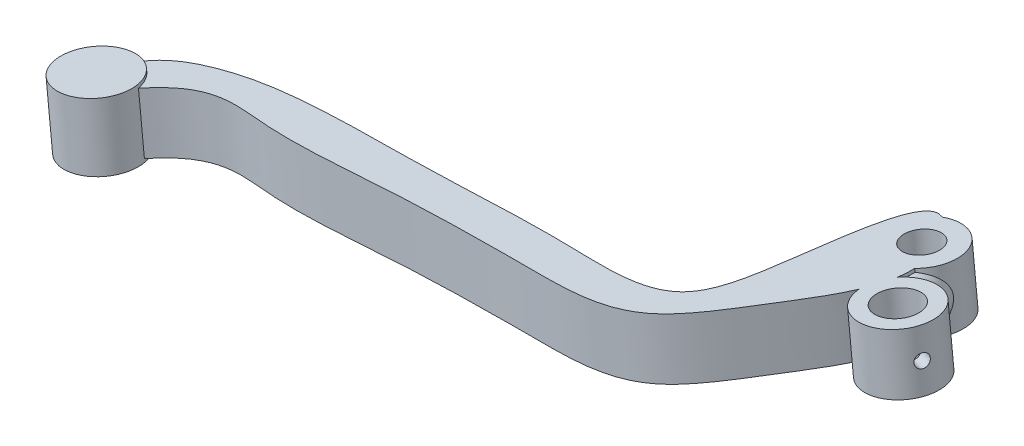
ISO-10303-21;
HEADER;
FILE_DESCRIPTION(('STEP AP214'),'2;1');
FILE_NAME('part.step','',(''),(''),'','','');
FILE_SCHEMA(('AUTOMOTIVE_DESIGN { 1 0 10303 214 1 1 1 1 }'));
ENDSEC;
DATA;
#1=APPLICATION_CONTEXT('core data for automotive mechanical design processes');
#2=APPLICATION_PROTOCOL_DEFINITION('international standard','automotive_design',2000,#1);
#3=PRODUCT_CONTEXT('',#1,'mechanical');
#4=PRODUCT('Part','Part','',(#3));
#5=PRODUCT_RELATED_PRODUCT_CATEGORY('part','',(#4));
#6=PRODUCT_DEFINITION_FORMATION('','',#4);
#7=PRODUCT_DEFINITION_CONTEXT('part definition',#1,'design');
#8=PRODUCT_DEFINITION('design','',#6,#7);
#9=PRODUCT_DEFINITION_SHAPE('','',#8);
#10=(LENGTH_UNIT() NAMED_UNIT(*) SI_UNIT(.MILLI.,.METRE.));
#11=(NAMED_UNIT(*) PLANE_ANGLE_UNIT() SI_UNIT($,.RADIAN.));
#12=(NAMED_UNIT(*) SI_UNIT($,.STERADIAN.) SOLID_ANGLE_UNIT());
#13=UNCERTAINTY_MEASURE_WITH_UNIT(LENGTH_MEASURE(1.E-05),#10,'distance_accuracy_value','');
#14=(GEOMETRIC_REPRESENTATION_CONTEXT(3) GLOBAL_UNCERTAINTY_ASSIGNED_CONTEXT((#13)) GLOBAL_UNIT_ASSIGNED_CONTEXT((#10,
#11,#12)) REPRESENTATION_CONTEXT('',''));
#15=CARTESIAN_POINT('',(0.,0.,0.));
#16=DIRECTION('',(0.,0.,1.));
#17=DIRECTION('',(1.,0.,0.));
#18=AXIS2_PLACEMENT_3D('',#15,#16,#17);
#19=CARTESIAN_POINT('',(-251.154082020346,35.3664784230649,9.63590287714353));
#20=CARTESIAN_POINT('',(-252.144752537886,35.26541001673,6.79477720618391));
#21=CARTESIAN_POINT('',(-259.753498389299,34.4891642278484,-3.37683043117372));
#22=CARTESIAN_POINT('',(-262.065558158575,34.2532874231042,19.9311795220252));
#23=CARTESIAN_POINT('',(-265.881433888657,33.8639910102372,35.6466948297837));
#24=CARTESIAN_POINT('',(-287.423761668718,31.6662383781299,32.1428645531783));
#25=CARTESIAN_POINT('',(-305.955974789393,29.7755782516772,31.6126026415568));
#26=CARTESIAN_POINT('',(-325.574866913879,27.7740549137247,29.3290289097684));
#27=CARTESIAN_POINT('',(-340.025373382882,26.2998113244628,29.8606462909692));
#28=CARTESIAN_POINT('',(-349.502064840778,25.332997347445,34.200079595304));
#29=CARTESIAN_POINT('',(-350.796580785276,25.200930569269,47.4223544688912));
#30=CARTESIAN_POINT('',(-340.315774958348,26.2701844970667,32.7727968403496));
#31=CARTESIAN_POINT('',(-326.270514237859,27.7030848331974,36.7307682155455));
#32=CARTESIAN_POINT('',(-306.666064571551,29.703134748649,36.9124291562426));
#33=CARTESIAN_POINT('',(-287.296502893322,31.6792213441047,38.6130664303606));
#34=CARTESIAN_POINT('',(-266.955256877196,33.7544393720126,40.9172491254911));
#35=CARTESIAN_POINT('',(-257.023135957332,34.7677163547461,26.5391105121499));
#36=CARTESIAN_POINT('',(-248.785632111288,35.6081081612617,16.4283366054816));
#37=CARTESIAN_POINT('',(-251.154082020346,35.3664784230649,9.63590287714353));
#38=B_SPLINE_CURVE_WITH_KNOTS('',3,(#19,#20,#21,#22,#23,#24,#25,#26,#27,#28,#29,#30,#31,#32,#33,
#34,#35,#36,#37),.UNSPECIFIED.,.T.,.F.,(4,1,1,1,1,1,1,1,1,1,1,1,1,1,1,1,4),(0.,
0.0330213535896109,0.111967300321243,0.158059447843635,0.223215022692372,0.323820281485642,
0.404313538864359,0.457576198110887,0.499147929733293,0.523288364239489,0.564860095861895,
0.618122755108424,0.69861601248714,0.799221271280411,0.864376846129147,0.921054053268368,1.),.UNSPECIFIED.);
#39=DIRECTION('',(-0.101493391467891,0.994836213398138,0.));
#40=VECTOR('',#39,1.);
#41=SURFACE_OF_LINEAR_EXTRUSION('',#38,#40);
#42=CARTESIAN_POINT('',(-252.067522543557,44.3200043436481,9.63590287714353));
#43=CARTESIAN_POINT('',(-253.058193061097,44.2189359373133,6.79477720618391));
#44=CARTESIAN_POINT('',(-260.66693891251,43.4426901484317,-3.37683043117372));
#45=CARTESIAN_POINT('',(-262.978998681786,43.2068133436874,19.9311795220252));
#46=CARTESIAN_POINT('',(-266.794874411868,42.8175169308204,35.6466948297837));
#47=CARTESIAN_POINT('',(-288.337202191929,40.6197642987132,32.1428645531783));
#48=CARTESIAN_POINT('',(-306.869415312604,38.7291041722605,31.6126026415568));
#49=CARTESIAN_POINT('',(-326.48830743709,36.7275808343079,29.3290289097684));
#50=CARTESIAN_POINT('',(-340.938813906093,35.253337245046,29.8606462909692));
#51=CARTESIAN_POINT('',(-350.415505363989,34.2865232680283,34.200079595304));
#52=CARTESIAN_POINT('',(-351.710021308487,34.1544564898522,47.4223544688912));
#53=CARTESIAN_POINT('',(-341.229215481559,35.2237104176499,32.7727968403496));
#54=CARTESIAN_POINT('',(-327.18395476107,36.6566107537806,36.7307682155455));
#55=CARTESIAN_POINT('',(-307.579505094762,38.6566606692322,36.9124291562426));
#56=CARTESIAN_POINT('',(-288.209943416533,40.6327472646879,38.6130664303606));
#57=CARTESIAN_POINT('',(-267.868697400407,42.7079652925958,40.9172491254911));
#58=CARTESIAN_POINT('',(-257.936576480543,43.7212422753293,26.5391105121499));
#59=CARTESIAN_POINT('',(-249.699072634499,44.561634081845,16.4283366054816));
#60=CARTESIAN_POINT('',(-252.067522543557,44.3200043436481,9.63590287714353));
#61=B_SPLINE_CURVE_WITH_KNOTS('',3,(#42,#43,#44,#45,#46,#47,#48,#49,#50,#51,#52,#53,#54,#55,#56,
#57,#58,#59,#60),.UNSPECIFIED.,.T.,.F.,(4,1,1,1,1,1,1,1,1,1,1,1,1,1,1,1,4),(0.,
0.0330213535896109,0.111967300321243,0.158059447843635,0.223215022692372,0.323820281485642,
0.404313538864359,0.457576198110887,0.499147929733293,0.523288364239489,0.564860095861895,
0.618122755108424,0.69861601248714,0.799221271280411,0.864376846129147,0.921054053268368,1.),.UNSPECIFIED.);
#62=CARTESIAN_POINT('',(-344.957415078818,34.843358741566,39.0058739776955));
#63=VERTEX_POINT('',#62);
#64=CARTESIAN_POINT('',(-253.1402761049,44.210561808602,19.6783273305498));
#65=VERTEX_POINT('',#64);
#66=EDGE_CURVE('E274',#63,#65,#61,.T.);
#67=ORIENTED_EDGE('',*,*,#66,.F.);
#68=DIRECTION('',(-0.101493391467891,0.994836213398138,0.));
#69=VECTOR('',#68,1.);
#70=CARTESIAN_POINT('',(-344.043974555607,25.8898328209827,39.0058739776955));
#71=LINE('',#70,#69);
#72=CARTESIAN_POINT('',(-344.043974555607,25.8898328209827,39.0058739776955));
#73=VERTEX_POINT('',#72);
#74=EDGE_CURVE('E272',#73,#63,#71,.T.);
#75=ORIENTED_EDGE('',*,*,#74,.F.);
#76=CARTESIAN_POINT('',(-252.226835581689,35.2570358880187,19.6783273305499));
#77=VERTEX_POINT('',#76);
#78=EDGE_CURVE('E263',#73,#77,#38,.T.);
#79=ORIENTED_EDGE('',*,*,#78,.T.);
#80=DIRECTION('',(-0.101493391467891,0.994836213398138,0.));
#81=VECTOR('',#80,1.);
#82=CARTESIAN_POINT('',(-252.226835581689,35.2570358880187,19.67832733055));
#83=LINE('',#82,#81);
#84=EDGE_CURVE('E160',#65,#77,#83,.F.);
#85=ORIENTED_EDGE('',*,*,#84,.F.);
#86=EDGE_LOOP('',(#67,#75,#79,#85));
#87=FACE_BOUND('',#86,.T.);
#88=ADVANCED_FACE('F75',(#87),#41,.T.);
#89=CARTESIAN_POINT('',(-250.702465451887,35.4125524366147,15.2729450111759));
#90=VERTEX_POINT('',#89);
#91=CARTESIAN_POINT('',(-250.539004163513,35.4292287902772,12.7612058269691));
#92=VERTEX_POINT('',#91);
#93=EDGE_CURVE('E270',#90,#92,#38,.T.);
#94=ORIENTED_EDGE('',*,*,#93,.T.);
#95=DIRECTION('',(-0.101493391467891,0.994836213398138,0.));
#96=VECTOR('',#95,1.);
#97=CARTESIAN_POINT('',(-250.539004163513,35.4292287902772,12.7612058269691));
#98=LINE('',#97,#96);
#99=CARTESIAN_POINT('',(-250.591245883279,35.9413010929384,12.7612058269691));
#100=VERTEX_POINT('',#99);
#101=EDGE_CURVE('E165',#100,#92,#98,.F.);
#102=ORIENTED_EDGE('',*,*,#101,.F.);
#103=CARTESIAN_POINT('',(-251.400202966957,43.8706824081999,12.7612058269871));
#104=CARTESIAN_POINT('',(-251.393818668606,43.8777539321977,12.9069344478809));
#105=CARTESIAN_POINT('',(-251.390210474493,43.8826766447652,13.0529148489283));
#106=CARTESIAN_POINT('',(-251.388369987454,43.8873604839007,13.3454173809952));
#107=CARTESIAN_POINT('',(-251.390153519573,43.8871064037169,13.4919398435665));
#108=CARTESIAN_POINT('',(-251.398960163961,43.88051749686,13.7848525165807));
#109=CARTESIAN_POINT('',(-251.405988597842,43.8741764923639,13.9312424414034));
#110=CARTESIAN_POINT('',(-251.425114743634,43.8543891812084,14.2247779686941));
#111=CARTESIAN_POINT('',(-251.437265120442,43.8408686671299,14.3719152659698));
#112=CARTESIAN_POINT('',(-251.466244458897,43.8057509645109,14.6646233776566));
#113=CARTESIAN_POINT('',(-251.483068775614,43.7841617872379,14.8101955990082));
#114=CARTESIAN_POINT('',(-251.520890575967,43.7319989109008,15.0990760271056));
#115=CARTESIAN_POINT('',(-251.541884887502,43.7014320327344,15.2423858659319));
#116=CARTESIAN_POINT('',(-251.586032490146,43.6326117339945,15.517282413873));
#117=CARTESIAN_POINT('',(-251.608974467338,43.5949445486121,15.6490491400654));
#118=CARTESIAN_POINT('',(-251.657366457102,43.5102598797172,15.909097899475));
#119=CARTESIAN_POINT('',(-251.682816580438,43.4632419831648,16.0373797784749));
#120=CARTESIAN_POINT('',(-251.735373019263,43.3595276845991,16.2889640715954));
#121=CARTESIAN_POINT('',(-251.762471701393,43.3028739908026,16.412285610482));
#122=CARTESIAN_POINT('',(-251.817588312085,43.1793410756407,16.6534867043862));
#123=CARTESIAN_POINT('',(-251.845606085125,43.1124635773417,16.771367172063));
#124=CARTESIAN_POINT('',(-251.897331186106,42.9793250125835,16.9829689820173));
#125=CARTESIAN_POINT('',(-251.921040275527,42.9145438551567,17.0776219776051));
#126=CARTESIAN_POINT('',(-251.96784982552,42.7774547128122,17.2615181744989));
#127=CARTESIAN_POINT('',(-251.990950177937,42.7051454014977,17.3507604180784));
#128=CARTESIAN_POINT('',(-252.035920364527,42.5530569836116,17.5231242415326));
#129=CARTESIAN_POINT('',(-252.05778914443,42.4732716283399,17.6062405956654));
#130=CARTESIAN_POINT('',(-252.099622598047,42.3065491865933,17.7654814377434));
#131=CARTESIAN_POINT('',(-252.119587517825,42.219613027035,17.8416068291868));
#132=CARTESIAN_POINT('',(-252.157103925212,42.0383605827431,17.9866074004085));
#133=CARTESIAN_POINT('',(-252.174637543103,41.9439969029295,18.0554281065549));
#134=CARTESIAN_POINT('',(-252.206488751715,41.7490645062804,18.1844038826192));
#135=CARTESIAN_POINT('',(-252.220807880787,41.6484987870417,18.244563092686));
#136=CARTESIAN_POINT('',(-252.245662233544,41.4419256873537,18.3555117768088));
#137=CARTESIAN_POINT('',(-252.256199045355,41.3359206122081,18.4063051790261));
#138=CARTESIAN_POINT('',(-252.2730017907,41.1193568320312,18.4979034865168));
#139=CARTESIAN_POINT('',(-252.279268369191,41.0087988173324,18.5387098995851));
#140=CARTESIAN_POINT('',(-252.2866487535,40.7983278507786,18.6053241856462));
#141=CARTESIAN_POINT('',(-252.288311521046,40.6988249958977,18.6323729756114));
#142=CARTESIAN_POINT('',(-252.287896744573,40.4979329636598,18.6781449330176));
#143=CARTESIAN_POINT('',(-252.285819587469,40.3965439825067,18.6968689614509));
#144=CARTESIAN_POINT('',(-252.277824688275,40.1927468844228,18.7257848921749));
#145=CARTESIAN_POINT('',(-252.271908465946,40.0903391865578,18.7359801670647));
#146=CARTESIAN_POINT('',(-252.256221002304,39.8853238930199,18.7477390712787));
#147=CARTESIAN_POINT('',(-252.24644990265,39.7827163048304,18.7493030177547));
#148=CARTESIAN_POINT('',(-252.223972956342,39.5855930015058,18.7439842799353));
#149=CARTESIAN_POINT('',(-252.211531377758,39.4910301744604,18.7377060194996));
#150=CARTESIAN_POINT('',(-252.183515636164,39.3031227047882,18.7177688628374));
#151=CARTESIAN_POINT('',(-252.167940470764,39.2097784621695,18.7041076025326));
#152=CARTESIAN_POINT('',(-252.133853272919,39.0250391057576,18.6695391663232));
#153=CARTESIAN_POINT('',(-252.115342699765,38.9336430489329,18.6486355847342));
#154=CARTESIAN_POINT('',(-252.075611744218,38.7533285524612,18.5997655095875));
#155=CARTESIAN_POINT('',(-252.054390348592,38.6644110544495,18.5717963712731));
#156=CARTESIAN_POINT('',(-252.009502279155,38.4895411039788,18.5090094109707));
#157=CARTESIAN_POINT('',(-251.985832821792,38.4035921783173,18.4741837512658));
#158=CARTESIAN_POINT('',(-251.936396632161,38.2352497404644,18.3980091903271));
#159=CARTESIAN_POINT('',(-251.910629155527,38.1528575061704,18.3566579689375));
#160=CARTESIAN_POINT('',(-251.830721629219,37.9117333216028,18.2233324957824));
#161=CARTESIAN_POINT('',(-251.773938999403,37.7589107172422,18.12203453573));
#162=CARTESIAN_POINT('',(-251.652681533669,37.4625778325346,17.8905457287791));
#163=CARTESIAN_POINT('',(-251.587946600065,37.3203195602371,17.7589042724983));
#164=CARTESIAN_POINT('',(-251.457819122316,37.0583533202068,17.475151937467));
#165=CARTESIAN_POINT('',(-251.392426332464,36.9386541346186,17.3230331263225));
#166=CARTESIAN_POINT('',(-251.256460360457,36.7083956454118,16.9822598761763));
#167=CARTESIAN_POINT('',(-251.186266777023,36.6008679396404,16.7914160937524));
#168=CARTESIAN_POINT('',(-251.053714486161,36.4131370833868,16.3942612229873));
#169=CARTESIAN_POINT('',(-250.991359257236,36.3329460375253,16.1879433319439));
#170=CARTESIAN_POINT('',(-250.891417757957,36.2135353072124,15.8155289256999));
#171=CARTESIAN_POINT('',(-250.851480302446,36.16910069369,15.6516825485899));
#172=CARTESIAN_POINT('',(-250.779008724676,36.0929302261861,15.319395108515));
#173=CARTESIAN_POINT('',(-250.746478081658,36.0612003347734,15.1509519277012));
#174=CARTESIAN_POINT('',(-250.689527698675,36.0088136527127,14.8105917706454));
#175=CARTESIAN_POINT('',(-250.665128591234,35.9881849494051,14.6386671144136));
#176=CARTESIAN_POINT('',(-250.625041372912,35.9564681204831,14.2930131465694));
#177=CARTESIAN_POINT('',(-250.609350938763,35.945377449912,14.1192843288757));
#178=CARTESIAN_POINT('',(-250.585437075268,35.9301326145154,13.7475810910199));
#179=CARTESIAN_POINT('',(-250.57849601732,35.9271071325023,13.5494773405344));
#180=CARTESIAN_POINT('',(-250.576820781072,35.9284619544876,13.2529573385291));
#181=CARTESIAN_POINT('',(-250.57770300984,35.9298828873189,13.1545142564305));
#182=CARTESIAN_POINT('',(-250.582330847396,35.9344012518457,12.9577506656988));
#183=CARTESIAN_POINT('',(-250.58607594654,35.9374983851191,12.8594301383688));
#184=CARTESIAN_POINT('',(-250.591245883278,35.9413010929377,12.7612058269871));
#185=B_SPLINE_CURVE_WITH_KNOTS('',3,(#103,#104,#105,#106,#107,#108,#109,#110,#111,#112,#113,
#114,#115,#116,#117,#118,#119,#120,#121,#122,#123,#124,#125,#126,#127,#128,#129,#130,#131,#132,
#133,#134,#135,#136,#137,#138,#139,#140,#141,#142,#143,#144,#145,#146,#147,#148,#149,#150,#151,
#152,#153,#154,#155,#156,#157,#158,#159,#160,#161,#162,#163,#164,#165,#166,#167,#168,#169,#170,
#171,#172,#173,#174,#175,#176,#177,#178,#179,#180,#181,#182,#183,#184),.UNSPECIFIED.,.F.,.F.,(4,
2,2,2,2,2,2,2,2,2,2,2,2,2,2,2,2,2,2,2,2,2,2,2,2,2,2,2,2,2,2,2,2,2,2,2,2,2,2,2,4),(0.,
0.438116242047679,0.877519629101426,1.3173694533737,1.76185668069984,2.20590375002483,
2.64961431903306,3.0661180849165,3.48264025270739,3.89736223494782,4.31201439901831,
4.66304355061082,5.0141346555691,5.36552187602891,5.71686361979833,6.0706644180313,
6.42429553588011,6.77777799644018,7.13120705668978,7.44018308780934,7.749127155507,
8.05794899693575,8.36675949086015,8.65317131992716,8.93967491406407,9.22603652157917,
9.51250547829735,9.79930382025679,10.0862043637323,10.6595403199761,11.2701633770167,
11.8810236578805,12.5685352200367,13.2563508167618,13.7788645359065,14.3016231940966,
14.8256983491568,15.349633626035,15.9437787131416,16.2391049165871,16.5343785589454),.UNSPECIFIED.);
#186=CARTESIAN_POINT('',(-250.7711628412,36.0859228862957,15.2729450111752));
#187=VERTEX_POINT('',#186);
#188=EDGE_CURVE('E150',#187,#100,#185,.T.);
#189=ORIENTED_EDGE('',*,*,#188,.F.);
#190=DIRECTION('',(-0.101493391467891,0.994836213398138,0.));
#191=VECTOR('',#190,1.);
#192=CARTESIAN_POINT('',(-250.702465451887,35.4125524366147,15.2729450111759));
#193=LINE('',#192,#191);
#194=EDGE_CURVE('E156',#90,#187,#193,.T.);
#195=ORIENTED_EDGE('',*,*,#194,.F.);
#196=EDGE_LOOP('',(#94,#102,#189,#195));
#197=FACE_BOUND('',#196,.T.);
#198=ADVANCED_FACE('F163',(#197),#41,.T.);
#199=CARTESIAN_POINT('',(-256.741599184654,43.8431541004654,3.24667341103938));
#200=VERTEX_POINT('',#199);
#201=CARTESIAN_POINT('',(-348.712592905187,34.460254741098,34.8458584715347));
#202=VERTEX_POINT('',#201);
#203=EDGE_CURVE('E296',#200,#202,#61,.T.);
#204=ORIENTED_EDGE('',*,*,#203,.F.);
#205=DIRECTION('',(-0.101493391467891,0.994836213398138,0.));
#206=VECTOR('',#205,1.);
#207=CARTESIAN_POINT('',(-255.828158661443,34.8896281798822,3.24667341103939));
#208=LINE('',#207,#206);
#209=CARTESIAN_POINT('',(-255.828158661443,34.8896281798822,3.24667341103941));
#210=VERTEX_POINT('',#209);
#211=EDGE_CURVE('E288',#210,#200,#208,.T.);
#212=ORIENTED_EDGE('',*,*,#211,.F.);
#213=CARTESIAN_POINT('',(-347.799152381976,25.5067288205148,34.8458584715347));
#214=VERTEX_POINT('',#213);
#215=EDGE_CURVE('E269',#210,#214,#38,.T.);
#216=ORIENTED_EDGE('',*,*,#215,.T.);
#217=DIRECTION('',(-0.101493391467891,0.994836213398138,0.));
#218=VECTOR('',#217,1.);
#219=CARTESIAN_POINT('',(-347.799152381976,25.5067288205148,34.8458584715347));
#220=LINE('',#219,#218);
#221=EDGE_CURVE('E276',#202,#214,#220,.F.);
#222=ORIENTED_EDGE('',*,*,#221,.F.);
#223=EDGE_LOOP('',(#204,#212,#216,#222));
#224=FACE_BOUND('',#223,.T.);
#225=ADVANCED_FACE('F238',(#224),#41,.T.);
#226=CARTESIAN_POINT('',(-251.400202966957,43.870682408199,12.7612058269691));
#227=VERTEX_POINT('',#226);
#228=CARTESIAN_POINT('',(-251.547208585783,43.6927079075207,15.272945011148));
#229=VERTEX_POINT('',#228);
#230=EDGE_CURVE('E153',#227,#229,#185,.T.);
#231=ORIENTED_EDGE('',*,*,#230,.F.);
#232=CARTESIAN_POINT('',(-251.452444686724,44.3827547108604,12.7612058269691));
#233=VERTEX_POINT('',#232);
#234=EDGE_CURVE('E254',#233,#227,#98,.F.);
#235=ORIENTED_EDGE('',*,*,#234,.F.);
#236=CARTESIAN_POINT('',(-251.615905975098,44.366078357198,15.2729450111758));
#237=VERTEX_POINT('',#236);
#238=EDGE_CURVE('E256',#237,#233,#61,.T.);
#239=ORIENTED_EDGE('',*,*,#238,.F.);
#240=EDGE_CURVE('E161',#229,#237,#193,.T.);
#241=ORIENTED_EDGE('',*,*,#240,.F.);
#242=EDGE_LOOP('',(#231,#235,#239,#241));
#243=FACE_BOUND('',#242,.T.);
#244=ADVANCED_FACE('F77',(#243),#41,.T.);
#245=CARTESIAN_POINT('',(-349.205070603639,25.3632967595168,37.3542429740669));
#246=DIRECTION('',(0.101493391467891,-0.994836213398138,0.));
#247=DIRECTION('',(-0.994836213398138,-0.101493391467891,0.));
#248=AXIS2_PLACEMENT_3D('',#245,#246,#247);
#249=PLANE('',#248);
#250=CARTESIAN_POINT('',(-246.784319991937,35.8122824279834,19.1120011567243));
#251=DIRECTION('',(-0.101493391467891,0.994836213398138,0.));
#252=DIRECTION('',(-0.994836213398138,-0.101493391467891,0.));
#253=AXIS2_PLACEMENT_3D('',#250,#251,#252);
#254=CIRCLE('',#253,3.25000000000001);
#255=CARTESIAN_POINT('',(-250.017537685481,35.4824289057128,19.1120011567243));
#256=VERTEX_POINT('',#255);
#257=EDGE_CURVE('E199',#256,#256,#254,.T.);
#258=ORIENTED_EDGE('',*,*,#257,.T.);
#259=EDGE_LOOP('',(#258));
#260=FACE_BOUND('',#259,.T.);
#261=CARTESIAN_POINT('',(-253.828715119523,35.093611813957,8.3663038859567));
#262=DIRECTION('',(-0.101493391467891,0.994836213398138,0.));
#263=DIRECTION('',(-0.994836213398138,-0.101493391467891,0.));
#264=AXIS2_PLACEMENT_3D('',#261,#262,#263);
#265=CIRCLE('',#264,2.75000000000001);
#266=CARTESIAN_POINT('',(-251.092915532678,35.3727186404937,8.3663038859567));
#267=VERTEX_POINT('',#266);
#268=EDGE_CURVE('E198',#267,#267,#265,.T.);
#269=ORIENTED_EDGE('',*,*,#268,.T.);
#270=EDGE_LOOP('',(#269));
#271=FACE_BOUND('',#270,.T.);
#272=ORIENTED_EDGE('',*,*,#78,.F.);
#273=CARTESIAN_POINT('',(-349.4055070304,25.3428481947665,40.1034974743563));
#274=DIRECTION('',(-0.101493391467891,0.994836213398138,0.));
#275=DIRECTION('',(-0.994836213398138,-0.101493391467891,0.));
#276=AXIS2_PLACEMENT_3D('',#273,#274,#275);
#277=CIRCLE('',#276,5.50000000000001);
#278=EDGE_CURVE('E266',#73,#214,#277,.T.);
#279=ORIENTED_EDGE('',*,*,#278,.T.);
#280=ORIENTED_EDGE('',*,*,#215,.F.);
#281=CARTESIAN_POINT('',(-253.828715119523,35.0936118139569,8.3663038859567));
#282=DIRECTION('',(0.101493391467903,-0.994836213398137,0.));
#283=DIRECTION('',(0.994836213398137,0.101493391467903,0.));
#284=AXIS2_PLACEMENT_3D('',#281,#282,#283);
#285=CIRCLE('',#284,5.50000000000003);
#286=EDGE_CURVE('E283',#210,#92,#285,.T.);
#287=ORIENTED_EDGE('',*,*,#286,.T.);
#288=ORIENTED_EDGE('',*,*,#93,.F.);
#289=CARTESIAN_POINT('',(-246.784319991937,35.8122824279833,19.1120011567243));
#290=DIRECTION('',(0.101493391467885,-0.994836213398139,0.));
#291=DIRECTION('',(0.994836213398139,0.101493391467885,0.));
#292=AXIS2_PLACEMENT_3D('',#289,#290,#291);
#293=CIRCLE('',#292,5.49999999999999);
#294=EDGE_CURVE('E99',#90,#77,#293,.T.);
#295=ORIENTED_EDGE('',*,*,#294,.T.);
#296=EDGE_LOOP('',(#272,#279,#280,#287,#288,#295));
#297=FACE_BOUND('',#296,.T.);
#298=ADVANCED_FACE('F241',(#260,#271,#297),#249,.T.);
#299=CARTESIAN_POINT('',(-350.11851112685,34.3168226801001,37.3542429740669));
#300=DIRECTION('',(0.101493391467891,-0.994836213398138,0.));
#301=DIRECTION('',(-0.994836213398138,-0.101493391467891,0.));
#302=AXIS2_PLACEMENT_3D('',#299,#300,#301);
#303=PLANE('',#302);
#304=CARTESIAN_POINT('',(-247.697760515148,44.7658083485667,19.1120011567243));
#305=DIRECTION('',(-0.101493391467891,0.994836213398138,0.));
#306=DIRECTION('',(-0.994836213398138,-0.101493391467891,0.));
#307=AXIS2_PLACEMENT_3D('',#304,#305,#306);
#308=CIRCLE('',#307,3.25000000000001);
#309=CARTESIAN_POINT('',(-250.930978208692,44.435954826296,19.1120011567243));
#310=VERTEX_POINT('',#309);
#311=EDGE_CURVE('E200',#310,#310,#308,.T.);
#312=ORIENTED_EDGE('',*,*,#311,.F.);
#313=EDGE_LOOP('',(#312));
#314=FACE_BOUND('',#313,.T.);
#315=CARTESIAN_POINT('',(-254.742155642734,44.0471377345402,8.3663038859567));
#316=DIRECTION('',(-0.101493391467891,0.994836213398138,0.));
#317=DIRECTION('',(-0.994836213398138,-0.101493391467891,0.));
#318=AXIS2_PLACEMENT_3D('',#315,#316,#317);
#319=CIRCLE('',#318,2.75000000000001);
#320=CARTESIAN_POINT('',(-252.006356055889,44.3262445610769,8.3663038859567));
#321=VERTEX_POINT('',#320);
#322=EDGE_CURVE('E196',#321,#321,#319,.T.);
#323=ORIENTED_EDGE('',*,*,#322,.F.);
#324=EDGE_LOOP('',(#323));
#325=FACE_BOUND('',#324,.T.);
#326=ORIENTED_EDGE('',*,*,#238,.T.);
#327=CARTESIAN_POINT('',(-254.742155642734,44.0471377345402,8.3663038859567));
#328=DIRECTION('',(0.101493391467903,-0.994836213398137,0.));
#329=DIRECTION('',(0.994836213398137,0.101493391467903,0.));
#330=AXIS2_PLACEMENT_3D('',#327,#328,#329);
#331=CIRCLE('',#330,5.50000000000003);
#332=EDGE_CURVE('E285',#200,#233,#331,.T.);
#333=ORIENTED_EDGE('',*,*,#332,.F.);
#334=ORIENTED_EDGE('',*,*,#203,.T.);
#335=CARTESIAN_POINT('',(-350.318947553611,34.2963741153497,40.1034974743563));
#336=DIRECTION('',(-0.101493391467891,0.994836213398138,0.));
#337=DIRECTION('',(-0.994836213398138,-0.101493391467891,0.));
#338=AXIS2_PLACEMENT_3D('',#335,#336,#337);
#339=CIRCLE('',#338,5.50000000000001);
#340=EDGE_CURVE('E295',#63,#202,#339,.T.);
#341=ORIENTED_EDGE('',*,*,#340,.F.);
#342=ORIENTED_EDGE('',*,*,#66,.T.);
#343=CARTESIAN_POINT('',(-247.697760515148,44.7658083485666,19.1120011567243));
#344=DIRECTION('',(0.101493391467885,-0.994836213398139,0.));
#345=DIRECTION('',(0.994836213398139,0.101493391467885,0.));
#346=AXIS2_PLACEMENT_3D('',#343,#344,#345);
#347=CIRCLE('',#346,5.49999999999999);
#348=EDGE_CURVE('E257',#237,#65,#347,.T.);
#349=ORIENTED_EDGE('',*,*,#348,.F.);
#350=EDGE_LOOP('',(#326,#333,#334,#341,#342,#349));
#351=FACE_BOUND('',#350,.T.);
#352=ADVANCED_FACE('F247',(#314,#325,#351),#303,.F.);
#353=CARTESIAN_POINT('',(-253.828715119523,35.0936118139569,8.3663038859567));
#354=DIRECTION('',(-0.101493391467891,0.994836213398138,0.));
#355=DIRECTION('',(0.994836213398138,0.101493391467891,0.));
#356=AXIS2_PLACEMENT_3D('',#353,#354,#355);
#357=CYLINDRICAL_SURFACE('',#356,5.50000000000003);
#358=CARTESIAN_POINT('',(-255.555983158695,39.7820371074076,13.7241189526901));
#359=CARTESIAN_POINT('',(-255.554122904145,39.8842134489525,13.7269537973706));
#360=CARTESIAN_POINT('',(-255.546800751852,39.9863144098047,13.7310087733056));
#361=CARTESIAN_POINT('',(-255.521870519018,40.1891799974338,13.7410663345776));
#362=CARTESIAN_POINT('',(-255.504251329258,40.2899430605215,13.7470710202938));
#363=CARTESIAN_POINT('',(-255.437081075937,40.5898329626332,13.7670574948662));
#364=CARTESIAN_POINT('',(-255.373243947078,40.7857568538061,13.7829801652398));
#365=CARTESIAN_POINT('',(-255.246830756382,41.0897506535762,13.8078123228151));
#366=CARTESIAN_POINT('',(-255.193691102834,41.2019887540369,13.817010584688));
#367=CARTESIAN_POINT('',(-255.077895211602,41.4215709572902,13.8338639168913));
#368=CARTESIAN_POINT('',(-255.015241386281,41.5289162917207,13.8415193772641));
#369=CARTESIAN_POINT('',(-254.881601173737,41.7384613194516,13.8541838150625));
#370=CARTESIAN_POINT('',(-254.810612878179,41.8406598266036,13.8591921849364));
#371=CARTESIAN_POINT('',(-254.661311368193,42.0396195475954,13.865570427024));
#372=CARTESIAN_POINT('',(-254.582998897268,42.1363813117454,13.8669406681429));
#373=CARTESIAN_POINT('',(-254.335838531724,42.4208965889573,13.8641753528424));
#374=CARTESIAN_POINT('',(-254.156699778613,42.5999024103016,13.8529294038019));
#375=CARTESIAN_POINT('',(-253.777732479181,42.9300485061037,13.8047626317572));
#376=CARTESIAN_POINT('',(-253.577937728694,43.0812332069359,13.7678831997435));
#377=CARTESIAN_POINT('',(-253.206736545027,43.3220495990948,13.6736761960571));
#378=CARTESIAN_POINT('',(-253.037976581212,43.4179453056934,13.6221365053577));
#379=CARTESIAN_POINT('',(-252.781596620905,43.542884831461,13.5288422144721));
#380=CARTESIAN_POINT('',(-252.695577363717,43.5813870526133,13.4950708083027));
#381=CARTESIAN_POINT('',(-252.523092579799,43.6516514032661,13.4221313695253));
#382=CARTESIAN_POINT('',(-252.436627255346,43.6834163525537,13.3829656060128));
#383=CARTESIAN_POINT('',(-252.26344598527,43.7399626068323,13.2990328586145));
#384=CARTESIAN_POINT('',(-252.176731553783,43.7647017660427,13.2542343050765));
#385=CARTESIAN_POINT('',(-252.004366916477,43.8065997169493,13.1594315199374));
#386=CARTESIAN_POINT('',(-251.918716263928,43.8237618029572,13.1094295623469));
#387=CARTESIAN_POINT('',(-251.749215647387,43.8502947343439,13.0045407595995));
#388=CARTESIAN_POINT('',(-251.66536569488,43.8596655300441,12.949653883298));
#389=CARTESIAN_POINT('',(-251.500205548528,43.870526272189,12.8354677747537));
#390=CARTESIAN_POINT('',(-251.418895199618,43.8720167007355,12.7761688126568));
#391=CARTESIAN_POINT('',(-251.266466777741,43.8673824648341,12.6591092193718));
#392=CARTESIAN_POINT('',(-251.195080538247,43.8619147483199,12.6016704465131));
#393=CARTESIAN_POINT('',(-251.055363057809,43.8446079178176,12.4840847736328));
#394=CARTESIAN_POINT('',(-250.987032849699,43.8327666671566,12.4239369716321));
#395=CARTESIAN_POINT('',(-250.787186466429,43.7879736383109,12.2402299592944));
#396=CARTESIAN_POINT('',(-250.660700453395,43.7457486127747,12.1133188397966));
#397=CARTESIAN_POINT('',(-250.41716792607,43.6362649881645,11.8486487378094));
#398=CARTESIAN_POINT('',(-250.300887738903,43.5678810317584,11.7106629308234));
#399=CARTESIAN_POINT('',(-250.085257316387,43.4093720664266,11.4340790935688));
#400=CARTESIAN_POINT('',(-249.985909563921,43.3192438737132,11.2954809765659));
#401=CARTESIAN_POINT('',(-249.787924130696,43.1029711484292,10.998478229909));
#402=CARTESIAN_POINT('',(-249.692233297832,42.9733157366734,10.8406764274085));
#403=CARTESIAN_POINT('',(-249.520360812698,42.6903984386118,10.5351424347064));
#404=CARTESIAN_POINT('',(-249.444228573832,42.5370782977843,10.387436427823));
#405=CARTESIAN_POINT('',(-249.337104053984,42.2771894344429,10.1672648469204));
#406=CARTESIAN_POINT('',(-249.300506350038,42.1776946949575,10.0890545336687));
#407=CARTESIAN_POINT('',(-249.232454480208,41.9714533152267,9.94016663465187));
#408=CARTESIAN_POINT('',(-249.201002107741,41.8647041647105,9.86949167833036));
#409=CARTESIAN_POINT('',(-249.142744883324,41.644581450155,9.73794578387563));
#410=CARTESIAN_POINT('',(-249.115925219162,41.5312306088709,9.67704364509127));
#411=CARTESIAN_POINT('',(-249.06624987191,41.2981372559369,9.56719723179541));
#412=CARTESIAN_POINT('',(-249.04339063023,41.1784006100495,9.51824220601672));
#413=CARTESIAN_POINT('',(-248.996234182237,40.9050414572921,9.42526843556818));
#414=CARTESIAN_POINT('',(-248.972814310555,40.7499564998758,9.38497116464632));
#415=CARTESIAN_POINT('',(-248.930691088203,40.4347691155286,9.33091965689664));
#416=CARTESIAN_POINT('',(-248.911979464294,40.2746760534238,9.31711857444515));
#417=CARTESIAN_POINT('',(-248.879362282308,39.9537864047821,9.31779772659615));
#418=CARTESIAN_POINT('',(-248.865464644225,39.7929890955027,9.33232430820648));
#419=CARTESIAN_POINT('',(-248.843329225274,39.4755181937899,9.38780300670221));
#420=CARTESIAN_POINT('',(-248.835100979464,39.3188519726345,9.42879941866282));
#421=CARTESIAN_POINT('',(-248.824051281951,38.9661831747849,9.54861158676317));
#422=CARTESIAN_POINT('',(-248.823645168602,38.7727613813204,9.63514957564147));
#423=CARTESIAN_POINT('',(-248.837305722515,38.4008691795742,9.83491953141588));
#424=CARTESIAN_POINT('',(-248.851396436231,38.2224241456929,9.94819560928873));
#425=CARTESIAN_POINT('',(-248.897416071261,37.8760231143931,10.1965613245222));
#426=CARTESIAN_POINT('',(-248.929854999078,37.7085269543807,10.3321923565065));
#427=CARTESIAN_POINT('',(-249.015836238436,37.3903525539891,10.6161675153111));
#428=CARTESIAN_POINT('',(-249.06938871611,37.2396824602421,10.7645177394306));
#429=CARTESIAN_POINT('',(-249.174742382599,37.0120793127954,11.0089720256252));
#430=CARTESIAN_POINT('',(-249.219096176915,36.9292894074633,11.1029116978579));
#431=CARTESIAN_POINT('',(-249.317202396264,36.7712270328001,11.292171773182));
#432=CARTESIAN_POINT('',(-249.370950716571,36.6959513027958,11.3874915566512));
#433=CARTESIAN_POINT('',(-249.488239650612,36.553722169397,11.5781477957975));
#434=CARTESIAN_POINT('',(-249.55176923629,36.4867595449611,11.6734841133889));
#435=CARTESIAN_POINT('',(-249.688860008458,36.3619869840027,11.862836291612));
#436=CARTESIAN_POINT('',(-249.762416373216,36.304172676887,11.9568527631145));
#437=CARTESIAN_POINT('',(-249.953527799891,36.175863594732,12.1821144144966));
#438=CARTESIAN_POINT('',(-250.076391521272,36.1106256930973,12.3119611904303));
#439=CARTESIAN_POINT('',(-250.34123709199,36.0036483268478,12.5612608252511));
#440=CARTESIAN_POINT('',(-250.483201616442,35.9618877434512,12.6807229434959));
#441=CARTESIAN_POINT('',(-250.783433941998,35.9036470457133,12.9053304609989));
#442=CARTESIAN_POINT('',(-250.941742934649,35.887232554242,13.0104380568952));
#443=CARTESIAN_POINT('',(-251.269448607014,35.8804214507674,13.2026828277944));
#444=CARTESIAN_POINT('',(-251.43884784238,35.8900308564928,13.2898158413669));
#445=CARTESIAN_POINT('',(-251.777151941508,35.9334542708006,13.4418816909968));
#446=CARTESIAN_POINT('',(-251.945872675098,35.966422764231,13.5074760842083));
#447=CARTESIAN_POINT('',(-252.283722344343,36.0537441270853,13.6206878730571));
#448=CARTESIAN_POINT('',(-252.452851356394,36.1081013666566,13.6683015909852));
#449=CARTESIAN_POINT('',(-252.805233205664,36.2427786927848,13.7510355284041));
#450=CARTESIAN_POINT('',(-252.988096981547,36.3252306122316,13.7843112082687));
#451=CARTESIAN_POINT('',(-253.345394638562,36.511027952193,13.8333655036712));
#452=CARTESIAN_POINT('',(-253.519820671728,36.6143923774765,13.8491281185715));
#453=CARTESIAN_POINT('',(-253.888421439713,36.8614153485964,13.8681286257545));
#454=CARTESIAN_POINT('',(-254.080121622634,37.008996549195,13.8684457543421));
#455=CARTESIAN_POINT('',(-254.440606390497,37.3295937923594,13.8554581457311));
#456=CARTESIAN_POINT('',(-254.609385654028,37.5026157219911,13.8421502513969));
#457=CARTESIAN_POINT('',(-254.885343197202,37.836968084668,13.8128192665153));
#458=CARTESIAN_POINT('',(-254.99809615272,37.9937723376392,13.7978636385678));
#459=CARTESIAN_POINT('',(-255.197560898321,38.3232039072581,13.768885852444));
#460=CARTESIAN_POINT('',(-255.284321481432,38.4958007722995,13.7548619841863));
#461=CARTESIAN_POINT('',(-255.41244601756,38.823425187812,13.7346512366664));
#462=CARTESIAN_POINT('',(-255.459080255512,38.9762897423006,13.7275256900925));
#463=CARTESIAN_POINT('',(-255.509446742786,39.2096599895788,13.7213743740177));
#464=CARTESIAN_POINT('',(-255.522969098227,39.2880790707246,13.7200795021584));
#465=CARTESIAN_POINT('',(-255.543340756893,39.4457741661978,13.719076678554));
#466=CARTESIAN_POINT('',(-255.550193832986,39.5250496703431,13.7193678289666));
#467=CARTESIAN_POINT('',(-255.55500275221,39.6340237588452,13.7208420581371));
#468=CARTESIAN_POINT('',(-255.555843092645,39.6636291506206,13.7213511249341));
#469=CARTESIAN_POINT('',(-255.556602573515,39.7228375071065,13.7225790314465));
#470=CARTESIAN_POINT('',(-255.556522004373,39.752440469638,13.7232978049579));
#471=CARTESIAN_POINT('',(-255.555983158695,39.7820371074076,13.7241189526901));
#472=B_SPLINE_CURVE_WITH_KNOTS('',3,(#358,#359,#360,#361,#362,#363,#364,#365,#366,#367,#368,
#369,#370,#371,#372,#373,#374,#375,#376,#377,#378,#379,#380,#381,#382,#383,#384,#385,#386,#387,
#388,#389,#390,#391,#392,#393,#394,#395,#396,#397,#398,#399,#400,#401,#402,#403,#404,#405,#406,
#407,#408,#409,#410,#411,#412,#413,#414,#415,#416,#417,#418,#419,#420,#421,#422,#423,#424,#425,
#426,#427,#428,#429,#430,#431,#432,#433,#434,#435,#436,#437,#438,#439,#440,#441,#442,#443,#444,
#445,#446,#447,#448,#449,#450,#451,#452,#453,#454,#455,#456,#457,#458,#459,#460,#461,#462,#463,
#464,#465,#466,#467,#468,#469,#470,#471),.UNSPECIFIED.,.T.,.F.,(4,2,2,2,2,2,2,2,2,2,2,2,2,2,2,2,
2,2,2,2,2,2,2,2,2,2,2,2,2,2,2,2,2,2,2,2,2,2,2,2,2,2,2,2,2,2,2,2,2,2,2,2,2,2,2,2,4),(0.,
0.306652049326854,0.61363555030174,1.22997610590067,1.60318398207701,1.97629738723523,
2.34949639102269,2.72265755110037,3.47953525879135,4.23519364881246,4.8349628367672,
5.13497937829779,5.43487010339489,5.73652352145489,6.0380456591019,6.33956971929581,
6.64107533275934,6.91611563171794,7.19124819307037,7.7410855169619,8.31786735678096,
8.89473370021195,9.56891154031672,10.2447762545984,10.6395682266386,11.0344975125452,
11.4281397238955,11.8214263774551,12.305117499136,12.7879526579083,13.271578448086,
13.7560156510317,14.3882449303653,15.0215246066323,15.6733386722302,16.325466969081,
16.723508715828,17.1213769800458,17.5187999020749,17.9160323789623,18.4842849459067,
19.0520255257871,19.6212335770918,20.1905732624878,20.7402931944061,21.2901255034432,
21.8978802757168,22.5061898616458,23.2291583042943,23.9522943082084,24.5315142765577,
25.1096400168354,25.5872465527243,25.8257541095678,26.064126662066,26.1529802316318,
26.2418057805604),.UNSPECIFIED.);
#473=EDGE_CURVE('E91',#227,#100,#472,.T.);
#474=ORIENTED_EDGE('',*,*,#473,.T.);
#475=ORIENTED_EDGE('',*,*,#101,.T.);
#476=ORIENTED_EDGE('',*,*,#286,.F.);
#477=ORIENTED_EDGE('',*,*,#211,.T.);
#478=ORIENTED_EDGE('',*,*,#332,.T.);
#479=ORIENTED_EDGE('',*,*,#234,.T.);
#480=EDGE_LOOP('',(#474,#475,#476,#477,#478,#479));
#481=FACE_BOUND('',#480,.T.);
#482=ADVANCED_FACE('F308',(#481),#357,.T.);
#483=CARTESIAN_POINT('',(-349.354760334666,24.8454300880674,40.1034974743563));
#484=DIRECTION('',(-0.101493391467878,0.994836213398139,0.));
#485=DIRECTION('',(0.994836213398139,0.101493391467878,0.));
#486=AXIS2_PLACEMENT_3D('',#483,#484,#485);
#487=PLANE('',#486);
#488=CARTESIAN_POINT('',(-349.354760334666,24.8454300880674,40.1034974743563));
#489=DIRECTION('',(0.101493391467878,-0.994836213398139,0.));
#490=DIRECTION('',(0.994836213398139,0.101493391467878,0.));
#491=AXIS2_PLACEMENT_3D('',#488,#489,#490);
#492=CIRCLE('',#491,5.50000000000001);
#493=CARTESIAN_POINT('',(-343.883161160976,25.4036437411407,40.1034974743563));
#494=VERTEX_POINT('',#493);
#495=EDGE_CURVE('E167',#494,#494,#492,.T.);
#496=ORIENTED_EDGE('',*,*,#495,.T.);
#497=EDGE_LOOP('',(#496));
#498=FACE_BOUND('',#497,.T.);
#499=ADVANCED_FACE('F320',(#498),#487,.F.);
#500=CARTESIAN_POINT('',(-350.369694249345,34.7937922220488,40.1034974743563));
#501=DIRECTION('',(-0.101493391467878,0.994836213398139,0.));
#502=DIRECTION('',(0.994836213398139,0.101493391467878,0.));
#503=AXIS2_PLACEMENT_3D('',#500,#501,#502);
#504=PLANE('',#503);
#505=CARTESIAN_POINT('',(-350.369694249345,34.7937922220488,40.1034974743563));
#506=DIRECTION('',(0.101493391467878,-0.994836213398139,0.));
#507=DIRECTION('',(0.994836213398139,0.101493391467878,0.));
#508=AXIS2_PLACEMENT_3D('',#505,#506,#507);
#509=CIRCLE('',#508,5.50000000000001);
#510=CARTESIAN_POINT('',(-344.898095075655,35.3520058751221,40.1034974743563));
#511=VERTEX_POINT('',#510);
#512=EDGE_CURVE('E277',#511,#511,#509,.T.);
#513=ORIENTED_EDGE('',*,*,#512,.F.);
#514=EDGE_LOOP('',(#513));
#515=FACE_BOUND('',#514,.T.);
#516=ADVANCED_FACE('F314',(#515),#504,.T.);
#517=CARTESIAN_POINT('',(-349.354760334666,24.8454300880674,40.1034974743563));
#518=DIRECTION('',(-0.101493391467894,0.994836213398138,0.));
#519=DIRECTION('',(0.994836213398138,0.101493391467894,0.));
#520=AXIS2_PLACEMENT_3D('',#517,#518,#519);
#521=CYLINDRICAL_SURFACE('',#520,5.50000000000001);
#522=ORIENTED_EDGE('',*,*,#74,.T.);
#523=ORIENTED_EDGE('',*,*,#340,.T.);
#524=ORIENTED_EDGE('',*,*,#221,.T.);
#525=ORIENTED_EDGE('',*,*,#278,.F.);
#526=EDGE_LOOP('',(#522,#523,#524,#525));
#527=FACE_BOUND('',#526,.T.);
#528=ORIENTED_EDGE('',*,*,#512,.T.);
#529=EDGE_LOOP('',(#528));
#530=FACE_BOUND('',#529,.T.);
#531=ORIENTED_EDGE('',*,*,#495,.F.);
#532=EDGE_LOOP('',(#531));
#533=FACE_BOUND('',#532,.T.);
#534=ADVANCED_FACE('F180',(#527,#530,#533),#521,.T.);
#535=CARTESIAN_POINT('',(-254.285435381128,39.5703747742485,8.36630388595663));
#536=DIRECTION('',(0.547394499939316,0.0558452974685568,0.835009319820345));
#537=DIRECTION('',(-0.836314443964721,0.,0.548250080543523));
#538=AXIS2_PLACEMENT_3D('',#535,#536,#537);
#539=CYLINDRICAL_SURFACE('',#538,3.99999999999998);
#540=CARTESIAN_POINT('',(-252.661008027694,40.0773830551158,18.140186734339));
#541=CARTESIAN_POINT('',(-252.669101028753,40.1785439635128,18.1278386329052));
#542=CARTESIAN_POINT('',(-252.676116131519,40.2791822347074,18.1100231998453));
#543=CARTESIAN_POINT('',(-252.687723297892,40.4783202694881,18.0643456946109));
#544=CARTESIAN_POINT('',(-252.692312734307,40.5768176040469,18.0364727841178));
#545=CARTESIAN_POINT('',(-252.70200209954,40.8688662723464,17.9392156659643));
#546=CARTESIAN_POINT('',(-252.702955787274,41.0581801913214,17.856304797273));
#547=CARTESIAN_POINT('',(-252.693586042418,41.3502331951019,17.7025959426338));
#548=CARTESIAN_POINT('',(-252.687562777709,41.4576644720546,17.6399216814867));
#549=CARTESIAN_POINT('',(-252.669992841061,41.6672256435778,17.5069386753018));
#550=CARTESIAN_POINT('',(-252.65844756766,41.7693568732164,17.4366318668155));
#551=CARTESIAN_POINT('',(-252.629284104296,41.9682431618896,17.289924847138));
#552=CARTESIAN_POINT('',(-252.611664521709,42.0649969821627,17.2135232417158));
#553=CARTESIAN_POINT('',(-252.569831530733,42.2529927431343,17.0559663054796));
#554=CARTESIAN_POINT('',(-252.545618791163,42.3442352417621,16.9748114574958));
#555=CARTESIAN_POINT('',(-252.461444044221,42.6121226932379,16.7234237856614));
#556=CARTESIAN_POINT('',(-252.39032344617,42.7801084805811,16.5474042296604));
#557=CARTESIAN_POINT('',(-252.21461688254,43.089517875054,16.1891784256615));
#558=CARTESIAN_POINT('',(-252.110085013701,43.2309838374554,16.0069826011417));
#559=CARTESIAN_POINT('',(-251.88994087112,43.4563893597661,15.6823493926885));
#560=CARTESIAN_POINT('',(-251.781063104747,43.5461758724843,15.5394638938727));
#561=CARTESIAN_POINT('',(-251.600679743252,43.6633622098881,15.3302424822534));
#562=CARTESIAN_POINT('',(-251.537691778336,43.6995147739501,15.2613385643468));
#563=CARTESIAN_POINT('',(-251.406191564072,43.7655978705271,15.1258802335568));
#564=CARTESIAN_POINT('',(-251.337681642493,43.7955310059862,15.0593248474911));
#565=CARTESIAN_POINT('',(-251.195013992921,43.8489642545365,14.928845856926));
#566=CARTESIAN_POINT('',(-251.120825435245,43.8724255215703,14.8649400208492));
#567=CARTESIAN_POINT('',(-250.967652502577,43.9123655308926,14.7408617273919));
#568=CARTESIAN_POINT('',(-250.888670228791,43.9288473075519,14.6806876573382));
#569=CARTESIAN_POINT('',(-250.726485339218,43.9546338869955,14.5646392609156));
#570=CARTESIAN_POINT('',(-250.643282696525,43.9639386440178,14.5087649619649));
#571=CARTESIAN_POINT('',(-250.4733797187,43.9752832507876,14.4018136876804));
#572=CARTESIAN_POINT('',(-250.386679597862,43.977323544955,14.3507364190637));
#573=CARTESIAN_POINT('',(-250.218304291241,43.9743162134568,14.2580026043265));
#574=CARTESIAN_POINT('',(-250.136856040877,43.9698750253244,14.2159126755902));
#575=CARTESIAN_POINT('',(-249.97231853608,43.9551003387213,14.1361880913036));
#576=CARTESIAN_POINT('',(-249.889228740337,43.9447648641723,14.0985549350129));
#577=CARTESIAN_POINT('',(-249.638470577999,43.9051658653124,13.9925100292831));
#578=CARTESIAN_POINT('',(-249.469186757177,43.8673070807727,13.9308837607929));
#579=CARTESIAN_POINT('',(-249.122954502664,43.7683009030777,13.8228744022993));
#580=CARTESIAN_POINT('',(-248.946036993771,43.7061031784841,13.7773862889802));
#581=CARTESIAN_POINT('',(-248.597097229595,43.5611944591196,13.704155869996));
#582=CARTESIAN_POINT('',(-248.425075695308,43.4784804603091,13.6764161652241));
#583=CARTESIAN_POINT('',(-248.061008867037,43.2791513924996,13.6327581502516));
#584=CARTESIAN_POINT('',(-247.870480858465,43.1591712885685,13.6196233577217));
#585=CARTESIAN_POINT('',(-247.505004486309,42.8960054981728,13.6094175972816));
#586=CARTESIAN_POINT('',(-247.330096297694,42.7527624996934,13.6123869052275));
#587=CARTESIAN_POINT('',(-247.070008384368,42.5084789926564,13.6255495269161));
#588=CARTESIAN_POINT('',(-246.977763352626,42.4146614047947,13.6322250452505));
#589=CARTESIAN_POINT('',(-246.801777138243,42.2194315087,13.6479829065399));
#590=CARTESIAN_POINT('',(-246.718038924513,42.1180165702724,13.6570660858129));
#591=CARTESIAN_POINT('',(-246.56098226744,41.9079733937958,13.6762313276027));
#592=CARTESIAN_POINT('',(-246.487630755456,41.7993697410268,13.6863100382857));
#593=CARTESIAN_POINT('',(-246.353056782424,41.5749377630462,13.7059701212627));
#594=CARTESIAN_POINT('',(-246.291823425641,41.459116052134,13.7155519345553));
#595=CARTESIAN_POINT('',(-246.171221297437,41.1932498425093,13.7346140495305));
#596=CARTESIAN_POINT('',(-246.115516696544,41.0414585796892,13.7435647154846));
#597=CARTESIAN_POINT('',(-246.029955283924,40.7307027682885,13.7557749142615));
#598=CARTESIAN_POINT('',(-246.000052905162,40.5717513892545,13.7590444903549));
#599=CARTESIAN_POINT('',(-245.967984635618,40.2508057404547,13.7588863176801));
#600=CARTESIAN_POINT('',(-245.965864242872,40.0888069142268,13.7554475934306));
#601=CARTESIAN_POINT('',(-245.988300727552,39.766788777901,13.7429351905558));
#602=CARTESIAN_POINT('',(-246.012902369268,39.606773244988,13.7338520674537));
#603=CARTESIAN_POINT('',(-246.096440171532,39.2444546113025,13.7093780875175));
#604=CARTESIAN_POINT('',(-246.163561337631,39.0441436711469,13.6929082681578));
#605=CARTESIAN_POINT('',(-246.328919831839,38.6567752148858,13.6612743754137));
#606=CARTESIAN_POINT('',(-246.427208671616,38.4697402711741,13.6461125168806));
#607=CARTESIAN_POINT('',(-246.651516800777,38.1051502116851,13.6225124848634));
#608=CARTESIAN_POINT('',(-246.778263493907,37.9280327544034,13.6142840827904));
#609=CARTESIAN_POINT('',(-247.05286341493,37.5906154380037,13.6105355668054));
#610=CARTESIAN_POINT('',(-247.200726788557,37.4303237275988,13.6150215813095));
#611=CARTESIAN_POINT('',(-247.452498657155,37.1877829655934,13.6361258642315));
#612=CARTESIAN_POINT('',(-247.551086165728,37.0994601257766,13.6473360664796));
#613=CARTESIAN_POINT('',(-247.753749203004,36.9307308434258,13.6771025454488));
#614=CARTESIAN_POINT('',(-247.85782232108,36.8503209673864,13.6956556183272));
#615=CARTESIAN_POINT('',(-248.070416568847,36.6983687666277,13.7409307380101));
#616=CARTESIAN_POINT('',(-248.178932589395,36.6268166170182,13.7676436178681));
#617=CARTESIAN_POINT('',(-248.399336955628,36.4935443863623,13.8299071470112));
#618=CARTESIAN_POINT('',(-248.511223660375,36.4318196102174,13.8654535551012));
#619=CARTESIAN_POINT('',(-248.785885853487,36.2949866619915,13.9632647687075));
#620=CARTESIAN_POINT('',(-248.949831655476,36.2255575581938,14.0304439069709));
#621=CARTESIAN_POINT('',(-249.277319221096,36.1121894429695,14.184187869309));
#622=CARTESIAN_POINT('',(-249.440861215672,36.0682275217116,14.2707351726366));
#623=CARTESIAN_POINT('',(-249.762936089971,36.0077584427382,14.4620235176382));
#624=CARTESIAN_POINT('',(-249.921454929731,35.9913225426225,14.5668110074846));
#625=CARTESIAN_POINT('',(-250.228098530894,35.9866601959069,14.7911843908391));
#626=CARTESIAN_POINT('',(-250.376220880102,35.9984402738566,14.9107737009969));
#627=CARTESIAN_POINT('',(-250.653452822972,36.0480942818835,15.1560005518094));
#628=CARTESIAN_POINT('',(-250.783041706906,36.0850550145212,15.2812876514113));
#629=CARTESIAN_POINT('',(-251.02725662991,36.1819290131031,15.537332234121));
#630=CARTESIAN_POINT('',(-251.141879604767,36.2418469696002,15.6680908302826));
#631=CARTESIAN_POINT('',(-251.366951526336,36.3895124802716,15.9450265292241));
#632=CARTESIAN_POINT('',(-251.475688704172,36.4795268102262,16.0913767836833));
#633=CARTESIAN_POINT('',(-251.675067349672,36.6814350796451,16.3813247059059));
#634=CARTESIAN_POINT('',(-251.765692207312,36.7933489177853,16.5249197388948));
#635=CARTESIAN_POINT('',(-251.945869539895,37.0595948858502,16.8313460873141));
#636=CARTESIAN_POINT('',(-252.032000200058,37.2179463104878,16.992701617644));
#637=CARTESIAN_POINT('',(-252.184181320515,37.559794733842,17.2974656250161));
#638=CARTESIAN_POINT('',(-252.250227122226,37.7432975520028,17.4408699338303));
#639=CARTESIAN_POINT('',(-252.354437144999,38.0951716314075,17.6735269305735));
#640=CARTESIAN_POINT('',(-252.395534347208,38.2592862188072,17.7678767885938));
#641=CARTESIAN_POINT('',(-252.469114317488,38.6015605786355,17.9309268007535));
#642=CARTESIAN_POINT('',(-252.501613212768,38.7796932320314,17.999675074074));
#643=CARTESIAN_POINT('',(-252.554509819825,39.1149924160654,18.0942188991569));
#644=CARTESIAN_POINT('',(-252.576029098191,39.2704192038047,18.1254043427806));
#645=CARTESIAN_POINT('',(-252.604856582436,39.5059868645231,18.1521091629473));
#646=CARTESIAN_POINT('',(-252.613885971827,39.5848643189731,18.1576679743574));
#647=CARTESIAN_POINT('',(-252.630773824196,39.7429148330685,18.1619794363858));
#648=CARTESIAN_POINT('',(-252.63863294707,39.822087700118,18.1607359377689));
#649=CARTESIAN_POINT('',(-252.648570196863,39.9305385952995,18.1543872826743));
#650=CARTESIAN_POINT('',(-252.651182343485,39.9599632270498,18.152193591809));
#651=CARTESIAN_POINT('',(-252.656229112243,40.0187341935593,18.1468815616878));
#652=CARTESIAN_POINT('',(-252.658663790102,40.0480805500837,18.1437635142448));
#653=CARTESIAN_POINT('',(-252.661008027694,40.0773830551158,18.140186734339));
#654=B_SPLINE_CURVE_WITH_KNOTS('',3,(#540,#541,#542,#543,#544,#545,#546,#547,#548,#549,#550,
#551,#552,#553,#554,#555,#556,#557,#558,#559,#560,#561,#562,#563,#564,#565,#566,#567,#568,#569,
#570,#571,#572,#573,#574,#575,#576,#577,#578,#579,#580,#581,#582,#583,#584,#585,#586,#587,#588,
#589,#590,#591,#592,#593,#594,#595,#596,#597,#598,#599,#600,#601,#602,#603,#604,#605,#606,#607,
#608,#609,#610,#611,#612,#613,#614,#615,#616,#617,#618,#619,#620,#621,#622,#623,#624,#625,#626,
#627,#628,#629,#630,#631,#632,#633,#634,#635,#636,#637,#638,#639,#640,#641,#642,#643,#644,#645,
#646,#647,#648,#649,#650,#651,#652,#653),.UNSPECIFIED.,.T.,.F.,(4,2,2,2,2,2,2,2,2,2,2,2,2,2,2,2,
2,2,2,2,2,2,2,2,2,2,2,2,2,2,2,2,2,2,2,2,2,2,2,2,2,2,2,2,2,2,2,2,2,2,2,2,2,2,2,2,4),(0.,
0.30665204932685,0.613635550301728,1.22997610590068,1.60318398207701,1.97629738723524,
2.34949639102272,2.72265755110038,3.47953525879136,4.23519364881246,4.8349628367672,
5.13497937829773,5.43487010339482,5.73652352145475,6.03804565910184,6.33956971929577,
6.64107533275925,6.91611563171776,7.19124819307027,7.74108551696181,8.31786735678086,
8.89473370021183,9.56891154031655,10.2447762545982,10.6395682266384,11.0344975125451,
11.4281397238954,11.821426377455,12.3051174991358,12.7879526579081,13.2715784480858,
13.7560156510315,14.3882449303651,15.021524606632,15.6733386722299,16.3254669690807,
16.7235087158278,17.1213769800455,17.5187999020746,17.916032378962,18.4842849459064,
19.0520255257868,19.6212335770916,20.1905732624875,20.7402931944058,21.2901255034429,
21.8978802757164,22.5061898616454,23.2291583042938,23.9522943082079,24.5315142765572,
25.1096400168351,25.5872465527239,25.8257541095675,26.0641266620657,26.1529802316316,
26.2418057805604),.UNSPECIFIED.);
#655=EDGE_CURVE('E12',#229,#187,#654,.T.);
#656=ORIENTED_EDGE('',*,*,#655,.T.);
#657=ORIENTED_EDGE('',*,*,#188,.T.);
#658=ORIENTED_EDGE('',*,*,#473,.F.);
#659=ORIENTED_EDGE('',*,*,#230,.T.);
#660=EDGE_LOOP('',(#656,#657,#658,#659));
#661=FACE_BOUND('',#660,.T.);
#662=ADVANCED_FACE('F148',(#661),#539,.T.);
#663=CARTESIAN_POINT('',(-246.784319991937,35.8122824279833,19.1120011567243));
#664=DIRECTION('',(-0.101493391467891,0.994836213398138,0.));
#665=DIRECTION('',(0.994836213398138,0.101493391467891,0.));
#666=AXIS2_PLACEMENT_3D('',#663,#664,#665);
#667=CYLINDRICAL_SURFACE('',#666,5.49999999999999);
#668=CARTESIAN_POINT('',(-242.497839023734,40.8069247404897,21.8478713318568));
#669=CARTESIAN_POINT('',(-242.502543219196,40.8624426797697,21.8462074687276));
#670=CARTESIAN_POINT('',(-242.504879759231,40.9180669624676,21.8404250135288));
#671=CARTESIAN_POINT('',(-242.504843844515,41.0278948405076,21.8207571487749));
#672=CARTESIAN_POINT('',(-242.502467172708,41.0820971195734,21.8068644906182));
#673=CARTESIAN_POINT('',(-242.493315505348,41.1874512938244,21.7713342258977));
#674=CARTESIAN_POINT('',(-242.486544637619,41.2386060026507,21.749703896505));
#675=CARTESIAN_POINT('',(-242.469135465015,41.3364851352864,21.6992119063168));
#676=CARTESIAN_POINT('',(-242.458497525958,41.3832099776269,21.6703509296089));
#677=CARTESIAN_POINT('',(-242.43390039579,41.4714240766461,21.605711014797));
#678=CARTESIAN_POINT('',(-242.419906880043,41.5128519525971,21.5698613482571));
#679=CARTESIAN_POINT('',(-242.389453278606,41.5887055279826,21.4922788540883));
#680=CARTESIAN_POINT('',(-242.372993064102,41.6231308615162,21.450545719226));
#681=CARTESIAN_POINT('',(-242.338345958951,41.6841297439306,21.3619628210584));
#682=CARTESIAN_POINT('',(-242.320150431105,41.7106609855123,21.3150872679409));
#683=CARTESIAN_POINT('',(-242.282939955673,41.7547990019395,21.2176076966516));
#684=CARTESIAN_POINT('',(-242.263925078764,41.7724065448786,21.1670039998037));
#685=CARTESIAN_POINT('',(-242.226075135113,41.7979721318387,21.0640871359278));
#686=CARTESIAN_POINT('',(-242.207240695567,41.8060449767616,21.0118022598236));
#687=CARTESIAN_POINT('',(-242.170152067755,41.8126683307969,20.906432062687));
#688=CARTESIAN_POINT('',(-242.151897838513,41.8112195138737,20.8533467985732));
#689=CARTESIAN_POINT('',(-242.116638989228,41.7989229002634,20.7484872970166));
#690=CARTESIAN_POINT('',(-242.099623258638,41.7881739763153,20.6967051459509));
#691=CARTESIAN_POINT('',(-242.066939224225,41.7577593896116,20.5953842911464));
#692=CARTESIAN_POINT('',(-242.051270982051,41.7380933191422,20.5458456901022));
#693=CARTESIAN_POINT('',(-242.021331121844,41.6902769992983,20.4501142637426));
#694=CARTESIAN_POINT('',(-242.007070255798,41.6620672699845,20.4039478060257));
#695=CARTESIAN_POINT('',(-241.980102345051,41.5980427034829,20.316714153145));
#696=CARTESIAN_POINT('',(-241.967395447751,41.5622271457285,20.2756474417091));
#697=CARTESIAN_POINT('',(-241.943313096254,41.483446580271,20.1993152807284));
#698=CARTESIAN_POINT('',(-241.931958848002,41.4403882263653,20.1641394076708));
#699=CARTESIAN_POINT('',(-241.910698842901,41.3487050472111,20.1014308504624));
#700=CARTESIAN_POINT('',(-241.900793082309,41.3000802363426,20.0738981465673));
#701=CARTESIAN_POINT('',(-241.882354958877,41.1986732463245,20.027420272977));
#702=CARTESIAN_POINT('',(-241.87382186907,41.1458932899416,20.0084705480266));
#703=CARTESIAN_POINT('',(-241.858102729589,41.0376898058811,19.9798197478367));
#704=CARTESIAN_POINT('',(-241.850916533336,40.9822665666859,19.9701176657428));
#705=CARTESIAN_POINT('',(-241.838054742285,40.8712398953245,19.9603944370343));
#706=CARTESIAN_POINT('',(-241.832358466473,40.8156511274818,19.9602328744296));
#707=CARTESIAN_POINT('',(-241.822501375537,40.7050994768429,19.96924241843));
#708=CARTESIAN_POINT('',(-241.818340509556,40.6501365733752,19.978413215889));
#709=CARTESIAN_POINT('',(-241.811822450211,40.5427045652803,20.0056723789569));
#710=CARTESIAN_POINT('',(-241.809454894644,40.4902228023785,20.0237085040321));
#711=CARTESIAN_POINT('',(-241.806790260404,40.388821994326,20.0680510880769));
#712=CARTESIAN_POINT('',(-241.806493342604,40.3399032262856,20.0943581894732));
#713=CARTESIAN_POINT('',(-241.808316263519,40.246330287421,20.154752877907));
#714=CARTESIAN_POINT('',(-241.810465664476,40.2017355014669,20.1889315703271));
#715=CARTESIAN_POINT('',(-241.817562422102,40.1186545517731,20.2638054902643));
#716=CARTESIAN_POINT('',(-241.822509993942,40.0801688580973,20.304501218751));
#717=CARTESIAN_POINT('',(-241.835546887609,40.0099191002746,20.3916620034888));
#718=CARTESIAN_POINT('',(-241.843670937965,39.9782355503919,20.4381868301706));
#719=CARTESIAN_POINT('',(-241.863215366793,39.9230230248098,20.5352143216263));
#720=CARTESIAN_POINT('',(-241.874635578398,39.8994936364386,20.585716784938));
#721=CARTESIAN_POINT('',(-241.900663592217,39.8614008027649,20.6888053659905));
#722=CARTESIAN_POINT('',(-241.915248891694,39.8467767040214,20.7413747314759));
#723=CARTESIAN_POINT('',(-241.947419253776,39.8266787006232,20.8473366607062));
#724=CARTESIAN_POINT('',(-241.965004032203,39.8212039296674,20.9007291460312));
#725=CARTESIAN_POINT('',(-242.002446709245,39.8195787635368,21.0060097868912));
#726=CARTESIAN_POINT('',(-242.022269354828,39.8232989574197,21.0579085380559));
#727=CARTESIAN_POINT('',(-242.063735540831,39.8396788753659,21.1595197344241));
#728=CARTESIAN_POINT('',(-242.085379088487,39.8523386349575,21.2092321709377));
#729=CARTESIAN_POINT('',(-242.129687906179,39.8862369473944,21.3051757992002));
#730=CARTESIAN_POINT('',(-242.152353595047,39.907479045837,21.3514055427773));
#731=CARTESIAN_POINT('',(-242.197782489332,39.957955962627,21.4392190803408));
#732=CARTESIAN_POINT('',(-242.22054570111,39.9871913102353,21.4808025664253));
#733=CARTESIAN_POINT('',(-242.265514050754,40.0533510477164,21.5588980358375));
#734=CARTESIAN_POINT('',(-242.287706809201,40.0903779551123,21.5953303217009));
#735=CARTESIAN_POINT('',(-242.330185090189,40.1709018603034,21.6615762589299));
#736=CARTESIAN_POINT('',(-242.350470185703,40.2144003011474,21.6913884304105));
#737=CARTESIAN_POINT('',(-242.388298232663,40.3070371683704,21.7438701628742));
#738=CARTESIAN_POINT('',(-242.405821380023,40.3562123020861,21.7664892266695));
#739=CARTESIAN_POINT('',(-242.437084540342,40.4585881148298,21.803733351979));
#740=CARTESIAN_POINT('',(-242.450828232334,40.5117848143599,21.8183662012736));
#741=CARTESIAN_POINT('',(-242.470663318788,40.6054386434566,21.8363666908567));
#742=CARTESIAN_POINT('',(-242.4778198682,40.645299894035,21.8417399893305));
#743=CARTESIAN_POINT('',(-242.489686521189,40.7257300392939,21.8481010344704));
#744=CARTESIAN_POINT('',(-242.49439668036,40.7662989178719,21.8490888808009));
#745=CARTESIAN_POINT('',(-242.497839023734,40.8069247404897,21.8478713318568));
#746=B_SPLINE_CURVE_WITH_KNOTS('',3,(#668,#669,#670,#671,#672,#673,#674,#675,#676,#677,#678,
#679,#680,#681,#682,#683,#684,#685,#686,#687,#688,#689,#690,#691,#692,#693,#694,#695,#696,#697,
#698,#699,#700,#701,#702,#703,#704,#705,#706,#707,#708,#709,#710,#711,#712,#713,#714,#715,#716,
#717,#718,#719,#720,#721,#722,#723,#724,#725,#726,#727,#728,#729,#730,#731,#732,#733,#734,#735,
#736,#737,#738,#739,#740,#741,#742,#743,#744,#745),.UNSPECIFIED.,.T.,.F.,(4,2,2,2,2,2,2,2,2,2,2,
2,2,2,2,2,2,2,2,2,2,2,2,2,2,2,2,2,2,2,2,2,2,2,2,2,2,2,4),(0.,0.167075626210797,0.33430080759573,
0.501369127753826,0.66842164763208,0.837261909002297,1.00611099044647,1.17584933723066,
1.3455730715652,1.51323174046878,1.680878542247,1.84676463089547,2.01265830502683,
2.17973454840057,2.34682662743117,2.51626543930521,2.6857038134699,2.85505215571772,
3.02438205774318,3.19121915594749,3.35805072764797,3.52391079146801,3.68978374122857,
3.85768264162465,4.02559445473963,4.19539583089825,4.3651886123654,4.53381161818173,
4.70241865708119,4.8686662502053,5.03491450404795,5.20123150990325,5.367559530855,
5.53623070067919,5.70493953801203,5.87480786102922,6.04451023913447,6.16677232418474,
6.2890316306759),.UNSPECIFIED.);
#747=CARTESIAN_POINT('',(-242.497839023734,40.8069247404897,21.8478713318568));
#748=VERTEX_POINT('',#747);
#749=EDGE_CURVE('E202',#748,#748,#746,.T.);
#750=ORIENTED_EDGE('',*,*,#749,.T.);
#751=EDGE_LOOP('',(#750));
#752=FACE_BOUND('',#751,.T.);
#753=ORIENTED_EDGE('',*,*,#84,.T.);
#754=ORIENTED_EDGE('',*,*,#294,.F.);
#755=ORIENTED_EDGE('',*,*,#194,.T.);
#756=ORIENTED_EDGE('',*,*,#655,.F.);
#757=ORIENTED_EDGE('',*,*,#240,.T.);
#758=ORIENTED_EDGE('',*,*,#348,.T.);
#759=EDGE_LOOP('',(#753,#754,#755,#756,#757,#758));
#760=FACE_BOUND('',#759,.T.);
#761=ADVANCED_FACE('F157',(#752,#760),#667,.T.);
#762=CARTESIAN_POINT('',(-253.473488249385,31.6116850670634,8.3663038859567));
#763=DIRECTION('',(-0.10149339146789,0.994836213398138,0.));
#764=DIRECTION('',(0.994836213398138,0.10149339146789,0.));
#765=AXIS2_PLACEMENT_3D('',#762,#763,#764);
#766=CYLINDRICAL_SURFACE('',#765,2.75000000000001);
#767=CARTESIAN_POINT('',(-251.092915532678,35.3727186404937,8.3663038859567));
#768=CARTESIAN_POINT('',(-251.102430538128,35.4659845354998,8.3663038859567));
#769=CARTESIAN_POINT('',(-251.111945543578,35.5592504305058,8.3663038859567));
#770=CARTESIAN_POINT('',(-251.130975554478,35.745782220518,8.3663038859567));
#771=CARTESIAN_POINT('',(-251.140490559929,35.8390481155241,8.3663038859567));
#772=CARTESIAN_POINT('',(-251.159520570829,36.0255799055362,8.3663038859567));
#773=CARTESIAN_POINT('',(-251.169035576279,36.1188458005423,8.3663038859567));
#774=CARTESIAN_POINT('',(-251.188065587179,36.3053775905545,8.3663038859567));
#775=CARTESIAN_POINT('',(-251.197580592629,36.3986434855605,8.3663038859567));
#776=CARTESIAN_POINT('',(-251.216610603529,36.5851752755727,8.3663038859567));
#777=CARTESIAN_POINT('',(-251.22612560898,36.6784411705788,8.3663038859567));
#778=CARTESIAN_POINT('',(-251.24515561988,36.8649729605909,8.3663038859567));
#779=CARTESIAN_POINT('',(-251.25467062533,36.958238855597,8.3663038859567));
#780=CARTESIAN_POINT('',(-251.27370063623,37.1447706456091,8.3663038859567));
#781=CARTESIAN_POINT('',(-251.28321564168,37.2380365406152,8.3663038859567));
#782=CARTESIAN_POINT('',(-251.30224565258,37.4245683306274,8.3663038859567));
#783=CARTESIAN_POINT('',(-251.311760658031,37.5178342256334,8.3663038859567));
#784=CARTESIAN_POINT('',(-251.330790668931,37.7043660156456,8.3663038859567));
#785=CARTESIAN_POINT('',(-251.340305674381,37.7976319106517,8.3663038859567));
#786=CARTESIAN_POINT('',(-251.359335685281,37.9841637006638,8.3663038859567));
#787=CARTESIAN_POINT('',(-251.368850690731,38.0774295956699,8.3663038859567));
#788=CARTESIAN_POINT('',(-251.387880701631,38.263961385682,8.3663038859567));
#789=CARTESIAN_POINT('',(-251.397395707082,38.3572272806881,8.3663038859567));
#790=CARTESIAN_POINT('',(-251.416425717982,38.5437590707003,8.3663038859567));
#791=CARTESIAN_POINT('',(-251.425940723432,38.6370249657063,8.3663038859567));
#792=CARTESIAN_POINT('',(-251.444970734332,38.8235567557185,8.3663038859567));
#793=CARTESIAN_POINT('',(-251.454485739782,38.9168226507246,8.3663038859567));
#794=CARTESIAN_POINT('',(-251.473515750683,39.1033544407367,8.3663038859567));
#795=CARTESIAN_POINT('',(-251.483030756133,39.1966203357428,8.3663038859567));
#796=CARTESIAN_POINT('',(-251.502060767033,39.3831521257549,8.3663038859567));
#797=CARTESIAN_POINT('',(-251.511575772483,39.476418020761,8.3663038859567));
#798=CARTESIAN_POINT('',(-251.530605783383,39.6629498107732,8.3663038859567));
#799=CARTESIAN_POINT('',(-251.540120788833,39.7562157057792,8.3663038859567));
#800=CARTESIAN_POINT('',(-251.559150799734,39.9427474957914,8.3663038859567));
#801=CARTESIAN_POINT('',(-251.568665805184,40.0360133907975,8.3663038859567));
#802=CARTESIAN_POINT('',(-251.587695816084,40.2225451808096,8.3663038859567));
#803=CARTESIAN_POINT('',(-251.597210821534,40.3158110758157,8.3663038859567));
#804=CARTESIAN_POINT('',(-251.616240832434,40.5023428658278,8.3663038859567));
#805=CARTESIAN_POINT('',(-251.625755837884,40.5956087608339,8.3663038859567));
#806=CARTESIAN_POINT('',(-251.644785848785,40.7821405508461,8.3663038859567));
#807=CARTESIAN_POINT('',(-251.654300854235,40.8754064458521,8.3663038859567));
#808=CARTESIAN_POINT('',(-251.673330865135,41.0619382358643,8.3663038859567));
#809=CARTESIAN_POINT('',(-251.682845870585,41.1552041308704,8.3663038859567));
#810=CARTESIAN_POINT('',(-251.701875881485,41.3417359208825,8.3663038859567));
#811=CARTESIAN_POINT('',(-251.711390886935,41.4350018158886,8.3663038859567));
#812=CARTESIAN_POINT('',(-251.730420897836,41.6215336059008,8.3663038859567));
#813=CARTESIAN_POINT('',(-251.739935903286,41.7147995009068,8.3663038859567));
#814=CARTESIAN_POINT('',(-251.758965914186,41.901331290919,8.3663038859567));
#815=CARTESIAN_POINT('',(-251.768480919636,41.9945971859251,8.3663038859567));
#816=CARTESIAN_POINT('',(-251.787510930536,42.1811289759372,8.3663038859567));
#817=CARTESIAN_POINT('',(-251.797025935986,42.2743948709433,8.3663038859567));
#818=CARTESIAN_POINT('',(-251.816055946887,42.4609266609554,8.3663038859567));
#819=CARTESIAN_POINT('',(-251.825570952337,42.5541925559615,8.3663038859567));
#820=CARTESIAN_POINT('',(-251.844600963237,42.7407243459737,8.3663038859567));
#821=CARTESIAN_POINT('',(-251.854115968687,42.8339902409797,8.3663038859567));
#822=CARTESIAN_POINT('',(-251.873145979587,43.0205220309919,8.3663038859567));
#823=CARTESIAN_POINT('',(-251.882660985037,43.113787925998,8.3663038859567));
#824=CARTESIAN_POINT('',(-251.901690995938,43.3003197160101,8.3663038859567));
#825=CARTESIAN_POINT('',(-251.911206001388,43.3935856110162,8.3663038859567));
#826=CARTESIAN_POINT('',(-251.930236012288,43.5801174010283,8.3663038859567));
#827=CARTESIAN_POINT('',(-251.939751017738,43.6733832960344,8.3663038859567));
#828=CARTESIAN_POINT('',(-251.958781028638,43.8599150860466,8.3663038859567));
#829=CARTESIAN_POINT('',(-251.968296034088,43.9531809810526,8.3663038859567));
#830=CARTESIAN_POINT('',(-251.987326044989,44.1397127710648,8.3663038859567));
#831=CARTESIAN_POINT('',(-251.996841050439,44.2329786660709,8.3663038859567));
#832=CARTESIAN_POINT('',(-252.006356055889,44.3262445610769,8.3663038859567));
#833=B_SPLINE_CURVE_WITH_KNOTS('',3,(#767,#768,#769,#770,#771,#772,#773,#774,#775,#776,#777,
#778,#779,#780,#781,#782,#783,#784,#785,#786,#787,#788,#789,#790,#791,#792,#793,#794,#795,#796,
#797,#798,#799,#800,#801,#802,#803,#804,#805,#806,#807,#808,#809,#810,#811,#812,#813,#814,#815,
#816,#817,#818,#819,#820,#821,#822,#823,#824,#825,#826,#827,#828,#829,#830,#831,#832),
.UNSPECIFIED.,.F.,.F.,(4,2,2,2,2,2,2,2,2,2,2,2,2,2,2,2,2,2,2,2,2,2,2,2,2,2,2,2,2,2,2,2,4),(0.,
0.281250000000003,0.562500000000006,0.843750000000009,1.12500000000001,1.40625,1.6875,
1.96875000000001,2.25,2.53125,2.8125,3.09375000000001,3.37500000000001,3.65625,3.9375,4.21875,
4.5,4.78125,5.0625,5.34375,5.62500000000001,5.90625,6.1875,6.46875,6.75,7.03125,7.3125,7.59375,
7.875,8.15625,8.4375,8.71875,9.00000000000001),.UNSPECIFIED.);
#834=EDGE_CURVE('BSEAM224',#267,#321,#833,.T.);
#835=ORIENTED_EDGE('',*,*,#268,.F.);
#836=ORIENTED_EDGE('',*,*,#322,.T.);
#837=ORIENTED_EDGE('',*,*,#834,.T.);
#838=ORIENTED_EDGE('',*,*,#834,.F.);
#839=EDGE_LOOP('',(#835,#837,#836,#838));
#840=FACE_BOUND('',#839,.T.);
#841=ADVANCED_FACE('F224',(#840),#766,.F.);
#842=CARTESIAN_POINT('',(-246.632079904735,34.3200281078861,19.1120011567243));
#843=DIRECTION('',(-0.101493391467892,0.994836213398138,0.));
#844=DIRECTION('',(0.994836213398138,0.101493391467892,0.));
#845=AXIS2_PLACEMENT_3D('',#842,#843,#844);
#846=CYLINDRICAL_SURFACE('',#845,3.25000000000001);
#847=CARTESIAN_POINT('',(-244.671512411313,40.5851661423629,21.0801174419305));
#848=CARTESIAN_POINT('',(-244.675908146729,40.6399022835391,21.0785642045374));
#849=CARTESIAN_POINT('',(-244.677406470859,40.6947693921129,21.0732190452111));
#850=CARTESIAN_POINT('',(-244.6747661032,40.8031263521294,21.0550831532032));
#851=CARTESIAN_POINT('',(-244.670625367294,40.8566156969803,21.0422897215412));
#852=CARTESIAN_POINT('',(-244.657286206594,40.9605906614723,21.009593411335));
#853=CARTESIAN_POINT('',(-244.648097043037,41.0110815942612,20.9897035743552));
#854=CARTESIAN_POINT('',(-244.62550315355,41.1078527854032,20.9432168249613));
#855=CARTESIAN_POINT('',(-244.612097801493,41.1541324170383,20.9166189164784));
#856=CARTESIAN_POINT('',(-244.581582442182,41.2426792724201,20.8562659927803));
#857=CARTESIAN_POINT('',(-244.564370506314,41.2847777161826,20.8223147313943));
#858=CARTESIAN_POINT('',(-244.527635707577,41.3621369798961,20.7483936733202));
#859=CARTESIAN_POINT('',(-244.508112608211,41.3973970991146,20.708423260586));
#860=CARTESIAN_POINT('',(-244.467564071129,41.4605461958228,20.6225405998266));
#861=CARTESIAN_POINT('',(-244.446519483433,41.4883071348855,20.576542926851));
#862=CARTESIAN_POINT('',(-244.40436164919,41.5347295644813,20.4801925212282));
#863=CARTESIAN_POINT('',(-244.383248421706,41.5533933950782,20.4298409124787));
#864=CARTESIAN_POINT('',(-244.34266929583,41.5804477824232,20.3278999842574));
#865=CARTESIAN_POINT('',(-244.323171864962,41.589163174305,20.2764094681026));
#866=CARTESIAN_POINT('',(-244.285803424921,41.597106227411,20.1721282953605));
#867=CARTESIAN_POINT('',(-244.267932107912,41.5963356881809,20.1193378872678));
#868=CARTESIAN_POINT('',(-244.234799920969,41.5855274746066,20.0156557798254));
#869=CARTESIAN_POINT('',(-244.219476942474,41.5757677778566,19.9647545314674));
#870=CARTESIAN_POINT('',(-244.190988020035,41.5477450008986,19.8647245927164));
#871=CARTESIAN_POINT('',(-244.177822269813,41.5294811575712,19.8155960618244));
#872=CARTESIAN_POINT('',(-244.153379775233,41.4846777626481,19.7196814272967));
#873=CARTESIAN_POINT('',(-244.142139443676,41.4580011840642,19.6729501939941));
#874=CARTESIAN_POINT('',(-244.121562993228,41.3972843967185,19.5840730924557));
#875=CARTESIAN_POINT('',(-244.112227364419,41.3632422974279,19.5419284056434));
#876=CARTESIAN_POINT('',(-244.094723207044,41.2872050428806,19.4618546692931));
#877=CARTESIAN_POINT('',(-244.08661655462,41.2449455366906,19.4241626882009));
#878=CARTESIAN_POINT('',(-244.071534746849,41.1545818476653,19.3562947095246));
#879=CARTESIAN_POINT('',(-244.064559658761,41.1064773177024,19.3261191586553));
#880=CARTESIAN_POINT('',(-244.051234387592,41.0055001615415,19.2742994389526));
#881=CARTESIAN_POINT('',(-244.044887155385,40.9526070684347,19.2526942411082));
#882=CARTESIAN_POINT('',(-244.032499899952,40.8438058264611,19.2191659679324));
#883=CARTESIAN_POINT('',(-244.026459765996,40.7878987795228,19.2072393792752));
#884=CARTESIAN_POINT('',(-244.014801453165,40.6771947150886,19.1939262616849));
#885=CARTESIAN_POINT('',(-244.009176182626,40.6224486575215,19.1921208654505));
#886=CARTESIAN_POINT('',(-243.998207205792,40.5134467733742,19.1980110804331));
#887=CARTESIAN_POINT('',(-243.992863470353,40.4591908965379,19.2057057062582));
#888=CARTESIAN_POINT('',(-243.982920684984,40.353926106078,19.2299602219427));
#889=CARTESIAN_POINT('',(-243.978307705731,40.3028717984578,19.2463189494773));
#890=CARTESIAN_POINT('',(-243.970176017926,40.2040055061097,19.2871068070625));
#891=CARTESIAN_POINT('',(-243.966657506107,40.1561941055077,19.31153738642));
#892=CARTESIAN_POINT('',(-243.961212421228,40.0634057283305,19.3685171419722));
#893=CARTESIAN_POINT('',(-243.959341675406,40.0185725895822,19.4013057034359));
#894=CARTESIAN_POINT('',(-243.958067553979,39.9345231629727,19.4734770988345));
#895=CARTESIAN_POINT('',(-243.958664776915,39.8953082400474,19.5128615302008));
#896=CARTESIAN_POINT('',(-243.963049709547,39.8220600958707,19.5985981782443));
#897=CARTESIAN_POINT('',(-243.966954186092,39.7882710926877,19.64515368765));
#898=CARTESIAN_POINT('',(-243.978700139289,39.7285995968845,19.7426362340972));
#899=CARTESIAN_POINT('',(-243.986541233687,39.7027163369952,19.7935628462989));
#900=CARTESIAN_POINT('',(-244.006389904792,39.6599319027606,19.8974816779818));
#901=CARTESIAN_POINT('',(-244.01834005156,39.6429146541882,19.9504369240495));
#902=CARTESIAN_POINT('',(-244.046460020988,39.6179175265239,20.057346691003));
#903=CARTESIAN_POINT('',(-244.062628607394,39.6099350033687,20.1113009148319));
#904=CARTESIAN_POINT('',(-244.098110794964,39.6034161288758,20.2163185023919));
#905=CARTESIAN_POINT('',(-244.117272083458,39.6045134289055,20.2674109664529));
#906=CARTESIAN_POINT('',(-244.158533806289,39.6152362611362,20.3674643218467));
#907=CARTESIAN_POINT('',(-244.180634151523,39.6248615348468,20.41642527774));
#908=CARTESIAN_POINT('',(-244.226740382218,39.6522299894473,20.5106485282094));
#909=CARTESIAN_POINT('',(-244.250733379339,39.6699216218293,20.5559321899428));
#910=CARTESIAN_POINT('',(-244.299712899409,39.7128910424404,20.6421521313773));
#911=CARTESIAN_POINT('',(-244.324699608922,39.7381702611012,20.6830875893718));
#912=CARTESIAN_POINT('',(-244.375439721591,39.7967161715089,20.7612189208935));
#913=CARTESIAN_POINT('',(-244.401188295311,39.8302379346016,20.7982268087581));
#914=CARTESIAN_POINT('',(-244.451253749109,39.9039458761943,20.8660789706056));
#915=CARTESIAN_POINT('',(-244.475570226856,39.9441339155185,20.8969215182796));
#916=CARTESIAN_POINT('',(-244.522114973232,40.031468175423,20.952652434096));
#917=CARTESIAN_POINT('',(-244.544266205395,40.0787770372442,20.9773510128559));
#918=CARTESIAN_POINT('',(-244.584338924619,40.1782897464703,21.0191188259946));
#919=CARTESIAN_POINT('',(-244.602262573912,40.2304910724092,21.0361919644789));
#920=CARTESIAN_POINT('',(-244.631130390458,40.3326026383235,21.0609166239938));
#921=CARTESIAN_POINT('',(-244.64261422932,40.3821657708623,21.069377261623));
#922=CARTESIAN_POINT('',(-244.660748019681,40.482836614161,21.0797038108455));
#923=CARTESIAN_POINT('',(-244.667398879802,40.5339440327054,21.0815709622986));
#924=CARTESIAN_POINT('',(-244.671512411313,40.5851661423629,21.0801174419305));
#925=B_SPLINE_CURVE_WITH_KNOTS('',3,(#847,#848,#849,#850,#851,#852,#853,#854,#855,#856,#857,
#858,#859,#860,#861,#862,#863,#864,#865,#866,#867,#868,#869,#870,#871,#872,#873,#874,#875,#876,
#877,#878,#879,#880,#881,#882,#883,#884,#885,#886,#887,#888,#889,#890,#891,#892,#893,#894,#895,
#896,#897,#898,#899,#900,#901,#902,#903,#904,#905,#906,#907,#908,#909,#910,#911,#912,#913,#914,
#915,#916,#917,#918,#919,#920,#921,#922,#923,#924),.UNSPECIFIED.,.T.,.F.,(4,2,2,2,2,2,2,2,2,2,2,
2,2,2,2,2,2,2,2,2,2,2,2,2,2,2,2,2,2,2,2,2,2,2,2,2,2,2,4),(0.,0.164611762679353,
0.329283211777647,0.493653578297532,0.658048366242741,0.827537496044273,0.997043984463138,
1.16928397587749,1.34147963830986,1.5078757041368,1.67424020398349,1.83562680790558,
1.99702789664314,2.161206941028,2.32542817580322,2.4962401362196,2.66706224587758,
2.83865244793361,3.0101803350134,3.17455396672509,3.338910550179,3.49960839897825,
3.66033511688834,3.82631835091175,3.99234184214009,4.16448374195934,4.33660892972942,
4.5064201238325,4.67618160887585,4.8391280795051,5.00206961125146,5.16398414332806,
5.32592921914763,5.49371178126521,5.6615412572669,5.83404573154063,6.00646178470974,
6.16053453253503,6.31457830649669),.UNSPECIFIED.);
#926=CARTESIAN_POINT('',(-244.671512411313,40.5851661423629,21.0801174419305));
#927=VERTEX_POINT('',#926);
#928=EDGE_CURVE('E81',#927,#927,#925,.T.);
#929=ORIENTED_EDGE('',*,*,#928,.F.);
#930=EDGE_LOOP('',(#929));
#931=FACE_BOUND('',#930,.T.);
#932=ORIENTED_EDGE('',*,*,#257,.F.);
#933=EDGE_LOOP('',(#932));
#934=FACE_BOUND('',#933,.T.);
#935=ORIENTED_EDGE('',*,*,#311,.T.);
#936=EDGE_LOOP('',(#935));
#937=FACE_BOUND('',#936,.T.);
#938=ADVANCED_FACE('F219',(#931,#934,#937),#846,.F.);
#939=CARTESIAN_POINT('',(-247.241040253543,40.289045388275,19.1120011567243));
#940=DIRECTION('',(0.938579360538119,0.0957540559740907,0.331511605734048));
#941=DIRECTION('',(-0.333041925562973,0.,0.942912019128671));
#942=AXIS2_PLACEMENT_3D('',#939,#940,#941);
#943=CYLINDRICAL_SURFACE('',#942,1.);
#944=ORIENTED_EDGE('',*,*,#749,.F.);
#945=EDGE_LOOP('',(#944));
#946=FACE_BOUND('',#945,.T.);
#947=ORIENTED_EDGE('',*,*,#928,.T.);
#948=EDGE_LOOP('',(#947));
#949=FACE_BOUND('',#948,.T.);
#950=ADVANCED_FACE('F216',(#946,#949),#943,.F.);
#951=CLOSED_SHELL('',(#88,#198,#225,#244,#298,#352,#482,#499,#516,#534,#662,#761,#841,#938,#950));
#952=MANIFOLD_SOLID_BREP('B2',#951);
#953=ADVANCED_BREP_SHAPE_REPRESENTATION('',(#18,#952),#14);
#954=SHAPE_DEFINITION_REPRESENTATION(#9,#953);
ENDSEC;
END-ISO-10303-21;
